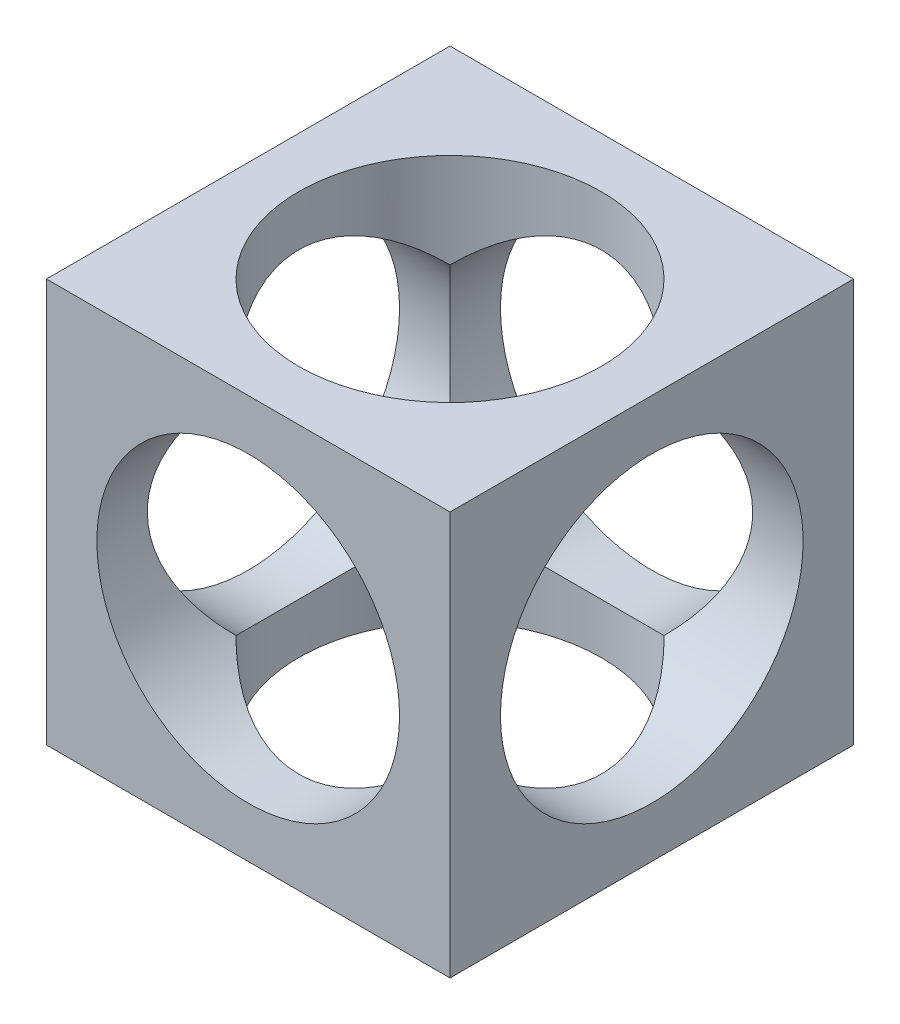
ISO-10303-21;
HEADER;
FILE_DESCRIPTION(('STEP AP214'),'2;1');
FILE_NAME('part.step','',(''),(''),'','','');
FILE_SCHEMA(('AUTOMOTIVE_DESIGN { 1 0 10303 214 1 1 1 1 }'));
ENDSEC;
DATA;
#1=APPLICATION_CONTEXT('core data for automotive mechanical design processes');
#2=APPLICATION_PROTOCOL_DEFINITION('international standard','automotive_design',2000,#1);
#3=PRODUCT_CONTEXT('',#1,'mechanical');
#4=PRODUCT('Part','Part','',(#3));
#5=PRODUCT_RELATED_PRODUCT_CATEGORY('part','',(#4));
#6=PRODUCT_DEFINITION_FORMATION('','',#4);
#7=PRODUCT_DEFINITION_CONTEXT('part definition',#1,'design');
#8=PRODUCT_DEFINITION('design','',#6,#7);
#9=PRODUCT_DEFINITION_SHAPE('','',#8);
#10=(LENGTH_UNIT() NAMED_UNIT(*) SI_UNIT(.MILLI.,.METRE.));
#11=(NAMED_UNIT(*) PLANE_ANGLE_UNIT() SI_UNIT($,.RADIAN.));
#12=(NAMED_UNIT(*) SI_UNIT($,.STERADIAN.) SOLID_ANGLE_UNIT());
#13=UNCERTAINTY_MEASURE_WITH_UNIT(LENGTH_MEASURE(1.E-05),#10,'distance_accuracy_value','');
#14=(GEOMETRIC_REPRESENTATION_CONTEXT(3) GLOBAL_UNCERTAINTY_ASSIGNED_CONTEXT((#13)) GLOBAL_UNIT_ASSIGNED_CONTEXT((#10,
#11,#12)) REPRESENTATION_CONTEXT('',''));
#15=CARTESIAN_POINT('',(0.,0.,0.));
#16=DIRECTION('',(0.,0.,1.));
#17=DIRECTION('',(1.,0.,0.));
#18=AXIS2_PLACEMENT_3D('',#15,#16,#17);
#19=CARTESIAN_POINT('',(-20.,0.,0.));
#20=DIRECTION('',(1.,0.,0.));
#21=DIRECTION('',(0.,0.,-1.));
#22=AXIS2_PLACEMENT_3D('',#19,#20,#21);
#23=CYLINDRICAL_SURFACE('',#22,15.);
#24=CARTESIAN_POINT('',(20.,0.,0.));
#25=DIRECTION('',(1.,0.,0.));
#26=DIRECTION('',(0.,0.,-1.));
#27=AXIS2_PLACEMENT_3D('',#24,#25,#26);
#28=CIRCLE('',#27,15.);
#29=CARTESIAN_POINT('',(20.,0.,-15.));
#30=VERTEX_POINT('',#29);
#31=EDGE_CURVE('E153',#30,#30,#28,.T.);
#32=ORIENTED_EDGE('',*,*,#31,.T.);
#33=EDGE_LOOP('',(#32));
#34=FACE_BOUND('',#33,.T.);
#35=CARTESIAN_POINT('',(0.,0.,0.));
#36=DIRECTION('',(0.707106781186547,0.,0.707106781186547));
#37=DIRECTION('',(0.707106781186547,0.,-0.707106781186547));
#38=AXIS2_PLACEMENT_3D('',#35,#36,#37);
#39=ELLIPSE('',#38,21.2132034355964,15.);
#40=CARTESIAN_POINT('',(10.6066017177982,10.6066017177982,-10.6066017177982));
#41=VERTEX_POINT('',#40);
#42=CARTESIAN_POINT('',(10.6066017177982,-10.6066017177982,-10.6066017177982));
#43=VERTEX_POINT('',#42);
#44=EDGE_CURVE('E110',#41,#43,#39,.F.);
#45=ORIENTED_EDGE('',*,*,#44,.T.);
#46=CARTESIAN_POINT('',(0.,0.,0.));
#47=DIRECTION('',(0.707106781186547,0.707106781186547,0.));
#48=DIRECTION('',(0.707106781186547,-0.707106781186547,0.));
#49=AXIS2_PLACEMENT_3D('',#46,#47,#48);
#50=ELLIPSE('',#49,21.2132034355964,15.);
#51=CARTESIAN_POINT('',(10.6066017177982,-10.6066017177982,10.6066017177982));
#52=VERTEX_POINT('',#51);
#53=EDGE_CURVE('E99',#43,#52,#50,.F.);
#54=ORIENTED_EDGE('',*,*,#53,.T.);
#55=CARTESIAN_POINT('',(0.,0.,0.));
#56=DIRECTION('',(0.707106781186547,0.,-0.707106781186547));
#57=DIRECTION('',(0.707106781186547,0.,0.707106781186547));
#58=AXIS2_PLACEMENT_3D('',#55,#56,#57);
#59=ELLIPSE('',#58,21.2132034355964,15.);
#60=CARTESIAN_POINT('',(10.6066017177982,10.6066017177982,10.6066017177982));
#61=VERTEX_POINT('',#60);
#62=EDGE_CURVE('E105',#52,#61,#59,.F.);
#63=ORIENTED_EDGE('',*,*,#62,.T.);
#64=CARTESIAN_POINT('',(0.,0.,0.));
#65=DIRECTION('',(0.707106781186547,-0.707106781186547,0.));
#66=DIRECTION('',(0.707106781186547,0.707106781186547,0.));
#67=AXIS2_PLACEMENT_3D('',#64,#65,#66);
#68=ELLIPSE('',#67,21.2132034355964,15.);
#69=EDGE_CURVE('E51',#61,#41,#68,.F.);
#70=ORIENTED_EDGE('',*,*,#69,.T.);
#71=EDGE_LOOP('',(#45,#54,#63,#70));
#72=FACE_BOUND('',#71,.T.);
#73=ADVANCED_FACE('F36',(#34,#72),#23,.F.);
#74=CARTESIAN_POINT('',(20.,20.,20.));
#75=DIRECTION('',(-1.,0.,0.));
#76=DIRECTION('',(0.,0.,1.));
#77=AXIS2_PLACEMENT_3D('',#74,#75,#76);
#78=PLANE('',#77);
#79=ORIENTED_EDGE('',*,*,#31,.F.);
#80=EDGE_LOOP('',(#79));
#81=FACE_BOUND('',#80,.T.);
#82=DIRECTION('',(0.,0.,-1.));
#83=VECTOR('',#82,1.);
#84=CARTESIAN_POINT('',(20.,-20.,20.));
#85=LINE('',#84,#83);
#86=CARTESIAN_POINT('',(20.,-20.,20.));
#87=VERTEX_POINT('',#86);
#88=CARTESIAN_POINT('',(20.,-20.,-20.));
#89=VERTEX_POINT('',#88);
#90=EDGE_CURVE('E142',#87,#89,#85,.T.);
#91=ORIENTED_EDGE('',*,*,#90,.T.);
#92=DIRECTION('',(0.,-1.,0.));
#93=VECTOR('',#92,1.);
#94=CARTESIAN_POINT('',(20.,20.,-20.));
#95=LINE('',#94,#93);
#96=CARTESIAN_POINT('',(20.,20.,-20.));
#97=VERTEX_POINT('',#96);
#98=EDGE_CURVE('E122',#97,#89,#95,.T.);
#99=ORIENTED_EDGE('',*,*,#98,.F.);
#100=DIRECTION('',(0.,0.,-1.));
#101=VECTOR('',#100,1.);
#102=CARTESIAN_POINT('',(20.,20.,20.));
#103=LINE('',#102,#101);
#104=CARTESIAN_POINT('',(20.,20.,20.));
#105=VERTEX_POINT('',#104);
#106=EDGE_CURVE('E137',#105,#97,#103,.T.);
#107=ORIENTED_EDGE('',*,*,#106,.F.);
#108=DIRECTION('',(0.,-1.,0.));
#109=VECTOR('',#108,1.);
#110=CARTESIAN_POINT('',(20.,20.,20.));
#111=LINE('',#110,#109);
#112=EDGE_CURVE('E131',#105,#87,#111,.T.);
#113=ORIENTED_EDGE('',*,*,#112,.T.);
#114=EDGE_LOOP('',(#91,#99,#107,#113));
#115=FACE_BOUND('',#114,.T.);
#116=ADVANCED_FACE('F38',(#81,#115),#78,.F.);
#117=CARTESIAN_POINT('',(-20.,20.,-20.));
#118=DIRECTION('',(0.,0.,1.));
#119=DIRECTION('',(1.,0.,0.));
#120=AXIS2_PLACEMENT_3D('',#117,#118,#119);
#121=PLANE('',#120);
#122=CARTESIAN_POINT('',(0.,0.,-20.));
#123=DIRECTION('',(0.,0.,-1.));
#124=DIRECTION('',(-1.,0.,0.));
#125=AXIS2_PLACEMENT_3D('',#122,#123,#124);
#126=CIRCLE('',#125,15.);
#127=CARTESIAN_POINT('',(-15.,0.,-20.));
#128=VERTEX_POINT('',#127);
#129=EDGE_CURVE('E159',#128,#128,#126,.T.);
#130=ORIENTED_EDGE('',*,*,#129,.F.);
#131=EDGE_LOOP('',(#130));
#132=FACE_BOUND('',#131,.T.);
#133=DIRECTION('',(-1.,0.,0.));
#134=VECTOR('',#133,1.);
#135=CARTESIAN_POINT('',(-20.,-20.,-20.));
#136=LINE('',#135,#134);
#137=CARTESIAN_POINT('',(-20.,-20.,-20.));
#138=VERTEX_POINT('',#137);
#139=EDGE_CURVE('E140',#89,#138,#136,.T.);
#140=ORIENTED_EDGE('',*,*,#139,.T.);
#141=DIRECTION('',(0.,-1.,0.));
#142=VECTOR('',#141,1.);
#143=CARTESIAN_POINT('',(-20.,20.,-20.));
#144=LINE('',#143,#142);
#145=CARTESIAN_POINT('',(-20.,20.,-20.));
#146=VERTEX_POINT('',#145);
#147=EDGE_CURVE('E125',#146,#138,#144,.T.);
#148=ORIENTED_EDGE('',*,*,#147,.F.);
#149=DIRECTION('',(-1.,0.,0.));
#150=VECTOR('',#149,1.);
#151=CARTESIAN_POINT('',(-20.,20.,-20.));
#152=LINE('',#151,#150);
#153=EDGE_CURVE('E149',#97,#146,#152,.T.);
#154=ORIENTED_EDGE('',*,*,#153,.F.);
#155=ORIENTED_EDGE('',*,*,#98,.T.);
#156=EDGE_LOOP('',(#140,#148,#154,#155));
#157=FACE_BOUND('',#156,.T.);
#158=ADVANCED_FACE('F201',(#132,#157),#121,.F.);
#159=CARTESIAN_POINT('',(-20.,20.,20.));
#160=DIRECTION('',(1.,0.,0.));
#161=DIRECTION('',(0.,0.,-1.));
#162=AXIS2_PLACEMENT_3D('',#159,#160,#161);
#163=PLANE('',#162);
#164=CARTESIAN_POINT('',(-20.,0.,0.));
#165=DIRECTION('',(1.,0.,0.));
#166=DIRECTION('',(0.,0.,-1.));
#167=AXIS2_PLACEMENT_3D('',#164,#165,#166);
#168=CIRCLE('',#167,15.);
#169=CARTESIAN_POINT('',(-20.,0.,-15.));
#170=VERTEX_POINT('',#169);
#171=EDGE_CURVE('E145',#170,#170,#168,.T.);
#172=ORIENTED_EDGE('',*,*,#171,.T.);
#173=EDGE_LOOP('',(#172));
#174=FACE_BOUND('',#173,.T.);
#175=DIRECTION('',(0.,0.,1.));
#176=VECTOR('',#175,1.);
#177=CARTESIAN_POINT('',(-20.,-20.,20.));
#178=LINE('',#177,#176);
#179=CARTESIAN_POINT('',(-20.,-20.,20.));
#180=VERTEX_POINT('',#179);
#181=EDGE_CURVE('E138',#138,#180,#178,.T.);
#182=ORIENTED_EDGE('',*,*,#181,.T.);
#183=DIRECTION('',(0.,-1.,0.));
#184=VECTOR('',#183,1.);
#185=CARTESIAN_POINT('',(-20.,20.,20.));
#186=LINE('',#185,#184);
#187=CARTESIAN_POINT('',(-20.,20.,20.));
#188=VERTEX_POINT('',#187);
#189=EDGE_CURVE('E128',#188,#180,#186,.T.);
#190=ORIENTED_EDGE('',*,*,#189,.F.);
#191=DIRECTION('',(0.,0.,1.));
#192=VECTOR('',#191,1.);
#193=CARTESIAN_POINT('',(-20.,20.,20.));
#194=LINE('',#193,#192);
#195=EDGE_CURVE('E147',#146,#188,#194,.T.);
#196=ORIENTED_EDGE('',*,*,#195,.F.);
#197=ORIENTED_EDGE('',*,*,#147,.T.);
#198=EDGE_LOOP('',(#182,#190,#196,#197));
#199=FACE_BOUND('',#198,.T.);
#200=ADVANCED_FACE('F217',(#174,#199),#163,.F.);
#201=CARTESIAN_POINT('',(-20.,20.,20.));
#202=DIRECTION('',(0.,0.,-1.));
#203=DIRECTION('',(-1.,0.,0.));
#204=AXIS2_PLACEMENT_3D('',#201,#202,#203);
#205=PLANE('',#204);
#206=CARTESIAN_POINT('',(0.,0.,20.));
#207=DIRECTION('',(0.,0.,-1.));
#208=DIRECTION('',(-1.,0.,0.));
#209=AXIS2_PLACEMENT_3D('',#206,#207,#208);
#210=CIRCLE('',#209,15.);
#211=CARTESIAN_POINT('',(-15.,0.,20.));
#212=VERTEX_POINT('',#211);
#213=EDGE_CURVE('E156',#212,#212,#210,.T.);
#214=ORIENTED_EDGE('',*,*,#213,.T.);
#215=EDGE_LOOP('',(#214));
#216=FACE_BOUND('',#215,.T.);
#217=DIRECTION('',(1.,0.,0.));
#218=VECTOR('',#217,1.);
#219=CARTESIAN_POINT('',(-20.,-20.,20.));
#220=LINE('',#219,#218);
#221=EDGE_CURVE('E135',#180,#87,#220,.T.);
#222=ORIENTED_EDGE('',*,*,#221,.T.);
#223=ORIENTED_EDGE('',*,*,#112,.F.);
#224=DIRECTION('',(1.,0.,0.));
#225=VECTOR('',#224,1.);
#226=CARTESIAN_POINT('',(-20.,20.,20.));
#227=LINE('',#226,#225);
#228=EDGE_CURVE('E134',#188,#105,#227,.T.);
#229=ORIENTED_EDGE('',*,*,#228,.F.);
#230=ORIENTED_EDGE('',*,*,#189,.T.);
#231=EDGE_LOOP('',(#222,#223,#229,#230));
#232=FACE_BOUND('',#231,.T.);
#233=ADVANCED_FACE('F220',(#216,#232),#205,.F.);
#234=CARTESIAN_POINT('',(0.,20.,0.));
#235=DIRECTION('',(0.,-1.,0.));
#236=DIRECTION('',(0.,0.,-1.));
#237=AXIS2_PLACEMENT_3D('',#234,#235,#236);
#238=PLANE('',#237);
#239=CARTESIAN_POINT('',(0.,20.,0.));
#240=DIRECTION('',(0.,1.,0.));
#241=DIRECTION('',(0.,0.,1.));
#242=AXIS2_PLACEMENT_3D('',#239,#240,#241);
#243=CIRCLE('',#242,15.);
#244=CARTESIAN_POINT('',(0.,20.,15.));
#245=VERTEX_POINT('',#244);
#246=EDGE_CURVE('E174',#245,#245,#243,.T.);
#247=ORIENTED_EDGE('',*,*,#246,.F.);
#248=EDGE_LOOP('',(#247));
#249=FACE_BOUND('',#248,.T.);
#250=ORIENTED_EDGE('',*,*,#106,.T.);
#251=ORIENTED_EDGE('',*,*,#153,.T.);
#252=ORIENTED_EDGE('',*,*,#195,.T.);
#253=ORIENTED_EDGE('',*,*,#228,.T.);
#254=EDGE_LOOP('',(#250,#251,#252,#253));
#255=FACE_BOUND('',#254,.T.);
#256=ADVANCED_FACE('F211',(#249,#255),#238,.F.);
#257=CARTESIAN_POINT('',(0.,-20.,0.));
#258=DIRECTION('',(0.,-1.,0.));
#259=DIRECTION('',(0.,0.,-1.));
#260=AXIS2_PLACEMENT_3D('',#257,#258,#259);
#261=PLANE('',#260);
#262=CARTESIAN_POINT('',(0.,-20.,0.));
#263=DIRECTION('',(0.,1.,0.));
#264=DIRECTION('',(0.,0.,1.));
#265=AXIS2_PLACEMENT_3D('',#262,#263,#264);
#266=CIRCLE('',#265,15.);
#267=CARTESIAN_POINT('',(0.,-20.,15.));
#268=VERTEX_POINT('',#267);
#269=EDGE_CURVE('E173',#268,#268,#266,.T.);
#270=ORIENTED_EDGE('',*,*,#269,.T.);
#271=EDGE_LOOP('',(#270));
#272=FACE_BOUND('',#271,.T.);
#273=ORIENTED_EDGE('',*,*,#90,.F.);
#274=ORIENTED_EDGE('',*,*,#221,.F.);
#275=ORIENTED_EDGE('',*,*,#181,.F.);
#276=ORIENTED_EDGE('',*,*,#139,.F.);
#277=EDGE_LOOP('',(#273,#274,#275,#276));
#278=FACE_BOUND('',#277,.T.);
#279=ADVANCED_FACE('F180',(#272,#278),#261,.T.);
#280=CARTESIAN_POINT('',(0.,0.,0.));
#281=DIRECTION('',(0.707106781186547,0.,-0.707106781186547));
#282=DIRECTION('',(0.707106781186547,0.,0.707106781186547));
#283=AXIS2_PLACEMENT_3D('',#280,#281,#282);
#284=ELLIPSE('',#283,21.2132034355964,15.);
#285=CARTESIAN_POINT('',(-10.6066017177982,-10.6066017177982,-10.6066017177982));
#286=VERTEX_POINT('',#285);
#287=CARTESIAN_POINT('',(-10.6066017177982,10.6066017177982,-10.6066017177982));
#288=VERTEX_POINT('',#287);
#289=EDGE_CURVE('E114',#286,#288,#284,.T.);
#290=ORIENTED_EDGE('',*,*,#289,.T.);
#291=CARTESIAN_POINT('',(0.,0.,0.));
#292=DIRECTION('',(0.707106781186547,0.707106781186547,0.));
#293=DIRECTION('',(0.707106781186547,-0.707106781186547,0.));
#294=AXIS2_PLACEMENT_3D('',#291,#292,#293);
#295=ELLIPSE('',#294,21.2132034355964,15.);
#296=CARTESIAN_POINT('',(-10.6066017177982,10.6066017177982,10.6066017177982));
#297=VERTEX_POINT('',#296);
#298=EDGE_CURVE('E168',#288,#297,#295,.T.);
#299=ORIENTED_EDGE('',*,*,#298,.T.);
#300=CARTESIAN_POINT('',(0.,0.,0.));
#301=DIRECTION('',(0.707106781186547,0.,0.707106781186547));
#302=DIRECTION('',(0.707106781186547,0.,-0.707106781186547));
#303=AXIS2_PLACEMENT_3D('',#300,#301,#302);
#304=ELLIPSE('',#303,21.2132034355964,15.);
#305=CARTESIAN_POINT('',(-10.6066017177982,-10.6066017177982,10.6066017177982));
#306=VERTEX_POINT('',#305);
#307=EDGE_CURVE('E117',#297,#306,#304,.T.);
#308=ORIENTED_EDGE('',*,*,#307,.T.);
#309=CARTESIAN_POINT('',(0.,0.,0.));
#310=DIRECTION('',(0.707106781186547,-0.707106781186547,0.));
#311=DIRECTION('',(0.707106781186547,0.707106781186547,0.));
#312=AXIS2_PLACEMENT_3D('',#309,#310,#311);
#313=ELLIPSE('',#312,21.2132034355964,15.);
#314=EDGE_CURVE('E58',#306,#286,#313,.T.);
#315=ORIENTED_EDGE('',*,*,#314,.T.);
#316=EDGE_LOOP('',(#290,#299,#308,#315));
#317=FACE_BOUND('',#316,.T.);
#318=ORIENTED_EDGE('',*,*,#171,.F.);
#319=EDGE_LOOP('',(#318));
#320=FACE_BOUND('',#319,.T.);
#321=ADVANCED_FACE('F197',(#317,#320),#23,.F.);
#322=CARTESIAN_POINT('',(0.,0.,20.));
#323=DIRECTION('',(0.,0.,-1.));
#324=DIRECTION('',(-1.,0.,0.));
#325=AXIS2_PLACEMENT_3D('',#322,#323,#324);
#326=CYLINDRICAL_SURFACE('',#325,15.);
#327=ORIENTED_EDGE('',*,*,#129,.T.);
#328=EDGE_LOOP('',(#327));
#329=FACE_BOUND('',#328,.T.);
#330=ORIENTED_EDGE('',*,*,#289,.F.);
#331=CARTESIAN_POINT('',(0.,0.,0.));
#332=DIRECTION('',(0.,0.707106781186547,-0.707106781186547));
#333=DIRECTION('',(0.,-0.707106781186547,-0.707106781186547));
#334=AXIS2_PLACEMENT_3D('',#331,#332,#333);
#335=ELLIPSE('',#334,21.2132034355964,15.);
#336=EDGE_CURVE('E111',#286,#43,#335,.F.);
#337=ORIENTED_EDGE('',*,*,#336,.T.);
#338=ORIENTED_EDGE('',*,*,#44,.F.);
#339=CARTESIAN_POINT('',(0.,0.,0.));
#340=DIRECTION('',(0.,-0.707106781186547,-0.707106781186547));
#341=DIRECTION('',(0.,0.707106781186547,-0.707106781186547));
#342=AXIS2_PLACEMENT_3D('',#339,#340,#341);
#343=ELLIPSE('',#342,21.2132034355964,15.);
#344=EDGE_CURVE('E162',#41,#288,#343,.F.);
#345=ORIENTED_EDGE('',*,*,#344,.T.);
#346=EDGE_LOOP('',(#330,#337,#338,#345));
#347=FACE_BOUND('',#346,.T.);
#348=ADVANCED_FACE('F191',(#329,#347),#326,.F.);
#349=ORIENTED_EDGE('',*,*,#213,.F.);
#350=EDGE_LOOP('',(#349));
#351=FACE_BOUND('',#350,.T.);
#352=ORIENTED_EDGE('',*,*,#307,.F.);
#353=CARTESIAN_POINT('',(0.,0.,0.));
#354=DIRECTION('',(0.,0.707106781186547,-0.707106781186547));
#355=DIRECTION('',(0.,-0.707106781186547,-0.707106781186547));
#356=AXIS2_PLACEMENT_3D('',#353,#354,#355);
#357=ELLIPSE('',#356,21.2132034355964,15.);
#358=EDGE_CURVE('E11',#297,#61,#357,.T.);
#359=ORIENTED_EDGE('',*,*,#358,.T.);
#360=ORIENTED_EDGE('',*,*,#62,.F.);
#361=CARTESIAN_POINT('',(0.,0.,0.));
#362=DIRECTION('',(0.,-0.707106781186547,-0.707106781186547));
#363=DIRECTION('',(0.,0.707106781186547,-0.707106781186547));
#364=AXIS2_PLACEMENT_3D('',#361,#362,#363);
#365=ELLIPSE('',#364,21.2132034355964,15.);
#366=EDGE_CURVE('E44',#52,#306,#365,.T.);
#367=ORIENTED_EDGE('',*,*,#366,.T.);
#368=EDGE_LOOP('',(#352,#359,#360,#367));
#369=FACE_BOUND('',#368,.T.);
#370=ADVANCED_FACE('F113',(#351,#369),#326,.F.);
#371=CARTESIAN_POINT('',(0.,-20.,0.));
#372=DIRECTION('',(0.,1.,0.));
#373=DIRECTION('',(0.,0.,1.));
#374=AXIS2_PLACEMENT_3D('',#371,#372,#373);
#375=CYLINDRICAL_SURFACE('',#374,15.);
#376=ORIENTED_EDGE('',*,*,#269,.F.);
#377=EDGE_LOOP('',(#376));
#378=FACE_BOUND('',#377,.T.);
#379=ORIENTED_EDGE('',*,*,#314,.F.);
#380=ORIENTED_EDGE('',*,*,#366,.F.);
#381=ORIENTED_EDGE('',*,*,#53,.F.);
#382=ORIENTED_EDGE('',*,*,#336,.F.);
#383=EDGE_LOOP('',(#379,#380,#381,#382));
#384=FACE_BOUND('',#383,.T.);
#385=ADVANCED_FACE('F98',(#378,#384),#375,.F.);
#386=ORIENTED_EDGE('',*,*,#246,.T.);
#387=EDGE_LOOP('',(#386));
#388=FACE_BOUND('',#387,.T.);
#389=ORIENTED_EDGE('',*,*,#69,.F.);
#390=ORIENTED_EDGE('',*,*,#358,.F.);
#391=ORIENTED_EDGE('',*,*,#298,.F.);
#392=ORIENTED_EDGE('',*,*,#344,.F.);
#393=EDGE_LOOP('',(#389,#390,#391,#392));
#394=FACE_BOUND('',#393,.T.);
#395=ADVANCED_FACE('F184',(#388,#394),#375,.F.);
#396=CLOSED_SHELL('',(#73,#116,#158,#200,#233,#256,#279,#321,#348,#370,#385,#395));
#397=MANIFOLD_SOLID_BREP('B2',#396);
#398=ADVANCED_BREP_SHAPE_REPRESENTATION('',(#18,#397),#14);
#399=SHAPE_DEFINITION_REPRESENTATION(#9,#398);
ENDSEC;
END-ISO-10303-21;
